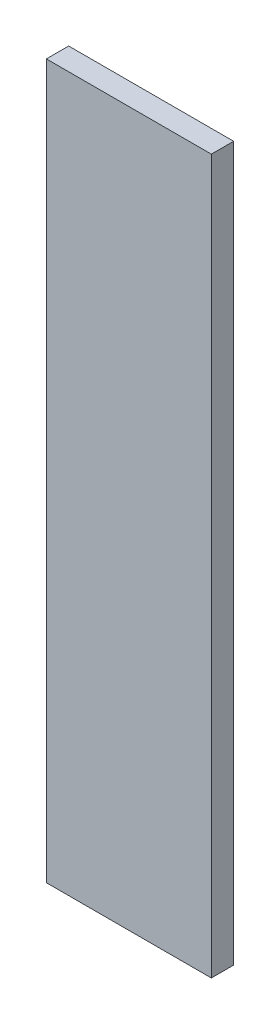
ISO-10303-21;
HEADER;
FILE_DESCRIPTION(('STEP AP214'),'2;1');
FILE_NAME('part.step','',(''),(''),'','','');
FILE_SCHEMA(('AUTOMOTIVE_DESIGN { 1 0 10303 214 1 1 1 1 }'));
ENDSEC;
DATA;
#1=APPLICATION_CONTEXT('core data for automotive mechanical design processes');
#2=APPLICATION_PROTOCOL_DEFINITION('international standard','automotive_design',2000,#1);
#3=PRODUCT_CONTEXT('',#1,'mechanical');
#4=PRODUCT('Part','Part','',(#3));
#5=PRODUCT_RELATED_PRODUCT_CATEGORY('part','',(#4));
#6=PRODUCT_DEFINITION_FORMATION('','',#4);
#7=PRODUCT_DEFINITION_CONTEXT('part definition',#1,'design');
#8=PRODUCT_DEFINITION('design','',#6,#7);
#9=PRODUCT_DEFINITION_SHAPE('','',#8);
#10=(LENGTH_UNIT() NAMED_UNIT(*) SI_UNIT(.MILLI.,.METRE.));
#11=(NAMED_UNIT(*) PLANE_ANGLE_UNIT() SI_UNIT($,.RADIAN.));
#12=(NAMED_UNIT(*) SI_UNIT($,.STERADIAN.) SOLID_ANGLE_UNIT());
#13=UNCERTAINTY_MEASURE_WITH_UNIT(LENGTH_MEASURE(1.E-05),#10,'distance_accuracy_value','');
#14=(GEOMETRIC_REPRESENTATION_CONTEXT(3) GLOBAL_UNCERTAINTY_ASSIGNED_CONTEXT((#13)) GLOBAL_UNIT_ASSIGNED_CONTEXT((#10,
#11,#12)) REPRESENTATION_CONTEXT('',''));
#15=CARTESIAN_POINT('',(0.,0.,0.));
#16=DIRECTION('',(0.,0.,1.));
#17=DIRECTION('',(1.,0.,0.));
#18=AXIS2_PLACEMENT_3D('',#15,#16,#17);
#19=CARTESIAN_POINT('',(0.,75.,5.));
#20=DIRECTION('',(-1.,0.,0.));
#21=DIRECTION('',(0.,-1.,0.));
#22=AXIS2_PLACEMENT_3D('',#19,#20,#21);
#23=PLANE('',#22);
#24=DIRECTION('',(0.,1.,0.));
#25=VECTOR('',#24,1.);
#26=CARTESIAN_POINT('',(0.,75.,0.));
#27=LINE('',#26,#25);
#28=CARTESIAN_POINT('',(0.,-85.,0.));
#29=VERTEX_POINT('',#28);
#30=CARTESIAN_POINT('',(0.,75.,0.));
#31=VERTEX_POINT('',#30);
#32=EDGE_CURVE('E96',#29,#31,#27,.T.);
#33=ORIENTED_EDGE('',*,*,#32,.T.);
#34=DIRECTION('',(0.,0.,-1.));
#35=VECTOR('',#34,1.);
#36=CARTESIAN_POINT('',(0.,75.,5.));
#37=LINE('',#36,#35);
#38=CARTESIAN_POINT('',(0.,75.,5.));
#39=VERTEX_POINT('',#38);
#40=EDGE_CURVE('E11',#39,#31,#37,.T.);
#41=ORIENTED_EDGE('',*,*,#40,.F.);
#42=DIRECTION('',(0.,1.,0.));
#43=VECTOR('',#42,1.);
#44=CARTESIAN_POINT('',(0.,75.,5.));
#45=LINE('',#44,#43);
#46=CARTESIAN_POINT('',(0.,-85.,5.));
#47=VERTEX_POINT('',#46);
#48=EDGE_CURVE('E84',#47,#39,#45,.T.);
#49=ORIENTED_EDGE('',*,*,#48,.F.);
#50=DIRECTION('',(0.,0.,-1.));
#51=VECTOR('',#50,1.);
#52=CARTESIAN_POINT('',(0.,-85.,5.));
#53=LINE('',#52,#51);
#54=EDGE_CURVE('E92',#47,#29,#53,.T.);
#55=ORIENTED_EDGE('',*,*,#54,.T.);
#56=EDGE_LOOP('',(#33,#41,#49,#55));
#57=FACE_BOUND('',#56,.T.);
#58=ADVANCED_FACE('F33',(#57),#23,.F.);
#59=CARTESIAN_POINT('',(-37.,75.,5.));
#60=DIRECTION('',(0.,-1.,0.));
#61=DIRECTION('',(0.,0.,-1.));
#62=AXIS2_PLACEMENT_3D('',#59,#60,#61);
#63=PLANE('',#62);
#64=DIRECTION('',(-1.,0.,0.));
#65=VECTOR('',#64,1.);
#66=CARTESIAN_POINT('',(-37.,75.,0.));
#67=LINE('',#66,#65);
#68=CARTESIAN_POINT('',(-37.,75.,0.));
#69=VERTEX_POINT('',#68);
#70=EDGE_CURVE('E88',#31,#69,#67,.T.);
#71=ORIENTED_EDGE('',*,*,#70,.T.);
#72=DIRECTION('',(0.,0.,-1.));
#73=VECTOR('',#72,1.);
#74=CARTESIAN_POINT('',(-37.,75.,5.));
#75=LINE('',#74,#73);
#76=CARTESIAN_POINT('',(-37.,75.,5.));
#77=VERTEX_POINT('',#76);
#78=EDGE_CURVE('E41',#77,#69,#75,.T.);
#79=ORIENTED_EDGE('',*,*,#78,.F.);
#80=DIRECTION('',(-1.,0.,0.));
#81=VECTOR('',#80,1.);
#82=CARTESIAN_POINT('',(-37.,75.,5.));
#83=LINE('',#82,#81);
#84=EDGE_CURVE('E79',#39,#77,#83,.T.);
#85=ORIENTED_EDGE('',*,*,#84,.F.);
#86=ORIENTED_EDGE('',*,*,#40,.T.);
#87=EDGE_LOOP('',(#71,#79,#85,#86));
#88=FACE_BOUND('',#87,.T.);
#89=ADVANCED_FACE('F87',(#88),#63,.F.);
#90=CARTESIAN_POINT('',(-37.,75.,5.));
#91=DIRECTION('',(1.,0.,0.));
#92=DIRECTION('',(0.,1.,0.));
#93=AXIS2_PLACEMENT_3D('',#90,#91,#92);
#94=PLANE('',#93);
#95=DIRECTION('',(0.,-1.,0.));
#96=VECTOR('',#95,1.);
#97=CARTESIAN_POINT('',(-37.,75.,0.));
#98=LINE('',#97,#96);
#99=CARTESIAN_POINT('',(-37.,-85.,0.));
#100=VERTEX_POINT('',#99);
#101=EDGE_CURVE('E66',#69,#100,#98,.T.);
#102=ORIENTED_EDGE('',*,*,#101,.T.);
#103=DIRECTION('',(0.,0.,-1.));
#104=VECTOR('',#103,1.);
#105=CARTESIAN_POINT('',(-37.,-85.,5.));
#106=LINE('',#105,#104);
#107=CARTESIAN_POINT('',(-37.,-85.,5.));
#108=VERTEX_POINT('',#107);
#109=EDGE_CURVE('E89',#108,#100,#106,.T.);
#110=ORIENTED_EDGE('',*,*,#109,.F.);
#111=DIRECTION('',(0.,-1.,0.));
#112=VECTOR('',#111,1.);
#113=CARTESIAN_POINT('',(-37.,75.,5.));
#114=LINE('',#113,#112);
#115=EDGE_CURVE('E82',#77,#108,#114,.T.);
#116=ORIENTED_EDGE('',*,*,#115,.F.);
#117=ORIENTED_EDGE('',*,*,#78,.T.);
#118=EDGE_LOOP('',(#102,#110,#116,#117));
#119=FACE_BOUND('',#118,.T.);
#120=ADVANCED_FACE('F90',(#119),#94,.F.);
#121=CARTESIAN_POINT('',(-37.,-85.,5.));
#122=DIRECTION('',(0.,1.,0.));
#123=DIRECTION('',(0.,0.,1.));
#124=AXIS2_PLACEMENT_3D('',#121,#122,#123);
#125=PLANE('',#124);
#126=DIRECTION('',(1.,0.,0.));
#127=VECTOR('',#126,1.);
#128=CARTESIAN_POINT('',(-37.,-85.,0.));
#129=LINE('',#128,#127);
#130=EDGE_CURVE('E72',#100,#29,#129,.T.);
#131=ORIENTED_EDGE('',*,*,#130,.T.);
#132=ORIENTED_EDGE('',*,*,#54,.F.);
#133=DIRECTION('',(1.,0.,0.));
#134=VECTOR('',#133,1.);
#135=CARTESIAN_POINT('',(-37.,-85.,5.));
#136=LINE('',#135,#134);
#137=EDGE_CURVE('E49',#108,#47,#136,.T.);
#138=ORIENTED_EDGE('',*,*,#137,.F.);
#139=ORIENTED_EDGE('',*,*,#109,.T.);
#140=EDGE_LOOP('',(#131,#132,#138,#139));
#141=FACE_BOUND('',#140,.T.);
#142=ADVANCED_FACE('F103',(#141),#125,.F.);
#143=CARTESIAN_POINT('',(0.,0.,5.));
#144=DIRECTION('',(0.,0.,1.));
#145=DIRECTION('',(1.,0.,0.));
#146=AXIS2_PLACEMENT_3D('',#143,#144,#145);
#147=PLANE('',#146);
#148=ORIENTED_EDGE('',*,*,#48,.T.);
#149=ORIENTED_EDGE('',*,*,#84,.T.);
#150=ORIENTED_EDGE('',*,*,#115,.T.);
#151=ORIENTED_EDGE('',*,*,#137,.T.);
#152=EDGE_LOOP('',(#148,#149,#150,#151));
#153=FACE_BOUND('',#152,.T.);
#154=ADVANCED_FACE('F80',(#153),#147,.T.);
#155=CARTESIAN_POINT('',(0.,0.,0.));
#156=DIRECTION('',(0.,0.,1.));
#157=DIRECTION('',(1.,0.,0.));
#158=AXIS2_PLACEMENT_3D('',#155,#156,#157);
#159=PLANE('',#158);
#160=ORIENTED_EDGE('',*,*,#32,.F.);
#161=ORIENTED_EDGE('',*,*,#130,.F.);
#162=ORIENTED_EDGE('',*,*,#101,.F.);
#163=ORIENTED_EDGE('',*,*,#70,.F.);
#164=EDGE_LOOP('',(#160,#161,#162,#163));
#165=FACE_BOUND('',#164,.T.);
#166=ADVANCED_FACE('F106',(#165),#159,.F.);
#167=CLOSED_SHELL('',(#58,#89,#120,#142,#154,#166));
#168=MANIFOLD_SOLID_BREP('B2',#167);
#169=ADVANCED_BREP_SHAPE_REPRESENTATION('',(#18,#168),#14);
#170=SHAPE_DEFINITION_REPRESENTATION(#9,#169);
ENDSEC;
END-ISO-10303-21;
